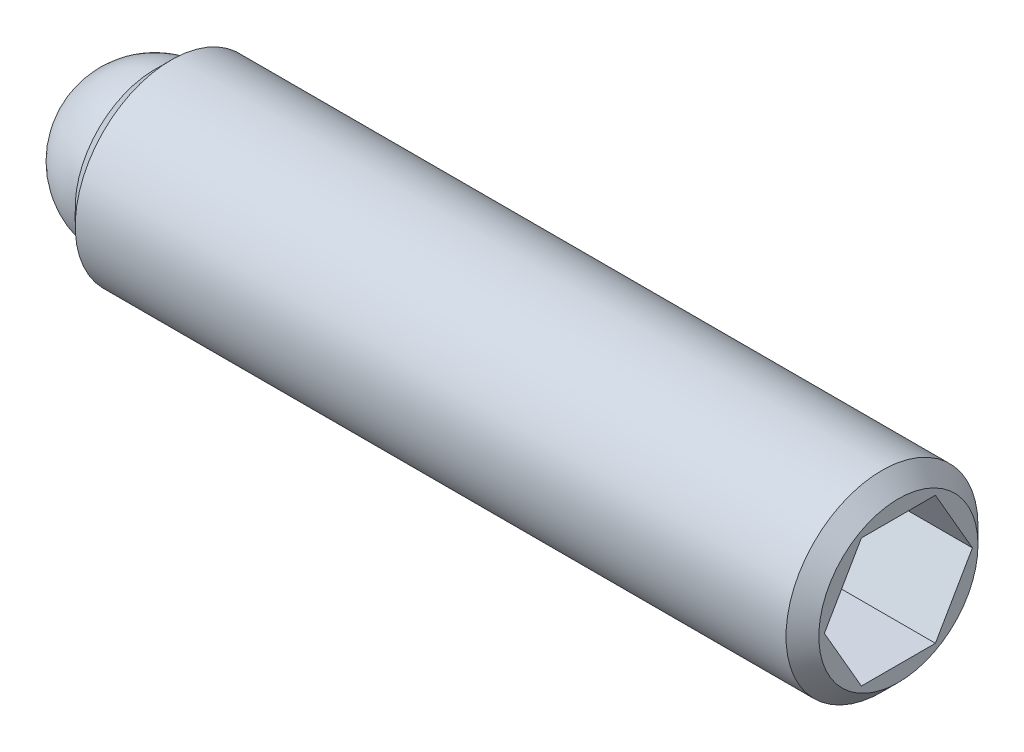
ISO-10303-21;
HEADER;
FILE_DESCRIPTION(('STEP AP214'),'2;1');
FILE_NAME('part.step','',(''),(''),'','','');
FILE_SCHEMA(('AUTOMOTIVE_DESIGN { 1 0 10303 214 1 1 1 1 }'));
ENDSEC;
DATA;
#1=APPLICATION_CONTEXT('core data for automotive mechanical design processes');
#2=APPLICATION_PROTOCOL_DEFINITION('international standard','automotive_design',2000,#1);
#3=PRODUCT_CONTEXT('',#1,'mechanical');
#4=PRODUCT('Part','Part','',(#3));
#5=PRODUCT_RELATED_PRODUCT_CATEGORY('part','',(#4));
#6=PRODUCT_DEFINITION_FORMATION('','',#4);
#7=PRODUCT_DEFINITION_CONTEXT('part definition',#1,'design');
#8=PRODUCT_DEFINITION('design','',#6,#7);
#9=PRODUCT_DEFINITION_SHAPE('','',#8);
#10=(LENGTH_UNIT() NAMED_UNIT(*) SI_UNIT(.MILLI.,.METRE.));
#11=(NAMED_UNIT(*) PLANE_ANGLE_UNIT() SI_UNIT($,.RADIAN.));
#12=(NAMED_UNIT(*) SI_UNIT($,.STERADIAN.) SOLID_ANGLE_UNIT());
#13=UNCERTAINTY_MEASURE_WITH_UNIT(LENGTH_MEASURE(1.E-05),#10,'distance_accuracy_value','');
#14=(GEOMETRIC_REPRESENTATION_CONTEXT(3) GLOBAL_UNCERTAINTY_ASSIGNED_CONTEXT((#13)) GLOBAL_UNIT_ASSIGNED_CONTEXT((#10,
#11,#12)) REPRESENTATION_CONTEXT('',''));
#15=CARTESIAN_POINT('',(0.,0.,0.));
#16=DIRECTION('',(0.,0.,1.));
#17=DIRECTION('',(1.,0.,0.));
#18=AXIS2_PLACEMENT_3D('',#15,#16,#17);
#19=CARTESIAN_POINT('',(0.,0.,0.));
#20=DIRECTION('',(0.,-1.,0.));
#21=DIRECTION('',(0.,0.,-1.));
#22=AXIS2_PLACEMENT_3D('',#19,#20,#21);
#23=SPHERICAL_SURFACE('',#22,1.190625);
#24=CARTESIAN_POINT('',(0.,-1.190625,0.));
#25=VERTEX_POINT('',#24);
#26=VERTEX_LOOP('',#25);
#27=FACE_BOUND('',#26,.T.);
#28=ADVANCED_FACE('F43',(#27),#23,.T.);
#29=CLOSED_SHELL('',(#28));
#30=MANIFOLD_SOLID_BREP('B2',#29);
#31=CARTESIAN_POINT('',(11.509375,0.,0.));
#32=DIRECTION('',(-1.,0.,0.));
#33=DIRECTION('',(0.,0.,1.));
#34=AXIS2_PLACEMENT_3D('',#31,#32,#33);
#35=CYLINDRICAL_SURFACE('',#34,1.4859);
#36=CARTESIAN_POINT('',(11.255375,0.,0.));
#37=DIRECTION('',(1.,0.,0.));
#38=DIRECTION('',(0.,0.,-1.));
#39=AXIS2_PLACEMENT_3D('',#36,#37,#38);
#40=CIRCLE('',#39,1.4859);
#41=CARTESIAN_POINT('',(11.255375,0.,-1.4859));
#42=VERTEX_POINT('',#41);
#43=EDGE_CURVE('E41',#42,#42,#40,.F.);
#44=ORIENTED_EDGE('',*,*,#43,.T.);
#45=EDGE_LOOP('',(#44));
#46=FACE_BOUND('',#45,.T.);
#47=CARTESIAN_POINT('',(0.254000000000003,0.,0.));
#48=DIRECTION('',(1.,0.,0.));
#49=DIRECTION('',(0.,0.,-1.));
#50=AXIS2_PLACEMENT_3D('',#47,#48,#49);
#51=CIRCLE('',#50,1.4859);
#52=CARTESIAN_POINT('',(0.254000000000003,0.,-1.4859));
#53=VERTEX_POINT('',#52);
#54=EDGE_CURVE('E159',#53,#53,#51,.T.);
#55=ORIENTED_EDGE('',*,*,#54,.T.);
#56=EDGE_LOOP('',(#55));
#57=FACE_BOUND('',#56,.T.);
#58=ADVANCED_FACE('F56',(#46,#57),#35,.T.);
#59=CARTESIAN_POINT('',(11.509375,0.,0.));
#60=DIRECTION('',(1.,0.,0.));
#61=DIRECTION('',(0.,0.,-1.));
#62=AXIS2_PLACEMENT_3D('',#59,#60,#61);
#63=PLANE('',#62);
#64=DIRECTION('',(0.,0.866025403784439,-0.5));
#65=VECTOR('',#64,1.);
#66=CARTESIAN_POINT('',(11.509375,-0.992187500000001,-0.572839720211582));
#67=LINE('',#66,#65);
#68=CARTESIAN_POINT('',(11.509375,-0.992187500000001,-0.572839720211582));
#69=VERTEX_POINT('',#68);
#70=CARTESIAN_POINT('',(11.509375,0.,-1.14567944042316));
#71=VERTEX_POINT('',#70);
#72=EDGE_CURVE('E71',#69,#71,#67,.T.);
#73=ORIENTED_EDGE('',*,*,#72,.F.);
#74=DIRECTION('',(0.,0.,-1.));
#75=VECTOR('',#74,1.);
#76=CARTESIAN_POINT('',(11.509375,-0.992187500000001,0.572839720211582));
#77=LINE('',#76,#75);
#78=CARTESIAN_POINT('',(11.509375,-0.992187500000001,0.572839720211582));
#79=VERTEX_POINT('',#78);
#80=EDGE_CURVE('E155',#79,#69,#77,.T.);
#81=ORIENTED_EDGE('',*,*,#80,.F.);
#82=DIRECTION('',(0.,-0.866025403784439,-0.5));
#83=VECTOR('',#82,1.);
#84=CARTESIAN_POINT('',(11.509375,0.,1.14567944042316));
#85=LINE('',#84,#83);
#86=CARTESIAN_POINT('',(11.509375,0.,1.14567944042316));
#87=VERTEX_POINT('',#86);
#88=EDGE_CURVE('E153',#87,#79,#85,.T.);
#89=ORIENTED_EDGE('',*,*,#88,.F.);
#90=DIRECTION('',(0.,-0.866025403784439,0.5));
#91=VECTOR('',#90,1.);
#92=CARTESIAN_POINT('',(11.509375,0.992187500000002,0.572839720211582));
#93=LINE('',#92,#91);
#94=CARTESIAN_POINT('',(11.509375,0.992187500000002,0.572839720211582));
#95=VERTEX_POINT('',#94);
#96=EDGE_CURVE('E119',#95,#87,#93,.T.);
#97=ORIENTED_EDGE('',*,*,#96,.F.);
#98=DIRECTION('',(0.,0.,1.));
#99=VECTOR('',#98,1.);
#100=CARTESIAN_POINT('',(11.509375,0.992187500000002,-0.572839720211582));
#101=LINE('',#100,#99);
#102=CARTESIAN_POINT('',(11.509375,0.992187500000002,-0.572839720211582));
#103=VERTEX_POINT('',#102);
#104=EDGE_CURVE('E149',#103,#95,#101,.T.);
#105=ORIENTED_EDGE('',*,*,#104,.F.);
#106=DIRECTION('',(0.,0.866025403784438,0.5));
#107=VECTOR('',#106,1.);
#108=CARTESIAN_POINT('',(11.509375,0.,-1.14567944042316));
#109=LINE('',#108,#107);
#110=EDGE_CURVE('E145',#71,#103,#109,.T.);
#111=ORIENTED_EDGE('',*,*,#110,.F.);
#112=EDGE_LOOP('',(#73,#81,#89,#97,#105,#111));
#113=FACE_BOUND('',#112,.T.);
#114=CARTESIAN_POINT('',(11.509375,0.,0.));
#115=DIRECTION('',(1.,0.,0.));
#116=DIRECTION('',(0.,0.,-1.));
#117=AXIS2_PLACEMENT_3D('',#114,#115,#116);
#118=CIRCLE('',#117,1.2319);
#119=CARTESIAN_POINT('',(11.509375,0.,-1.2319));
#120=VERTEX_POINT('',#119);
#121=EDGE_CURVE('E64',#120,#120,#118,.T.);
#122=ORIENTED_EDGE('',*,*,#121,.T.);
#123=EDGE_LOOP('',(#122));
#124=FACE_BOUND('',#123,.T.);
#125=ADVANCED_FACE('F172',(#113,#124),#63,.T.);
#126=CARTESIAN_POINT('',(0.,0.,0.));
#127=DIRECTION('',(1.,0.,0.));
#128=DIRECTION('',(0.,0.,-1.));
#129=AXIS2_PLACEMENT_3D('',#126,#127,#128);
#130=PLANE('',#129);
#131=CARTESIAN_POINT('',(0.,0.,0.));
#132=DIRECTION('',(-1.,0.,0.));
#133=DIRECTION('',(0.,0.,1.));
#134=AXIS2_PLACEMENT_3D('',#131,#132,#133);
#135=CIRCLE('',#134,1.190625);
#136=CARTESIAN_POINT('',(0.,0.,1.190625));
#137=VERTEX_POINT('',#136);
#138=EDGE_CURVE('E227',#137,#137,#135,.T.);
#139=ORIENTED_EDGE('',*,*,#138,.F.);
#140=EDGE_LOOP('',(#139));
#141=FACE_BOUND('',#140,.T.);
#142=CARTESIAN_POINT('',(0.,0.,0.));
#143=DIRECTION('',(1.,0.,0.));
#144=DIRECTION('',(0.,0.,-1.));
#145=AXIS2_PLACEMENT_3D('',#142,#143,#144);
#146=CIRCLE('',#145,1.2319);
#147=CARTESIAN_POINT('',(0.,0.,-1.2319));
#148=VERTEX_POINT('',#147);
#149=EDGE_CURVE('E167',#148,#148,#146,.F.);
#150=ORIENTED_EDGE('',*,*,#149,.T.);
#151=EDGE_LOOP('',(#150));
#152=FACE_BOUND('',#151,.T.);
#153=ADVANCED_FACE('F184',(#141,#152),#130,.F.);
#154=CARTESIAN_POINT('',(0.254000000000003,0.,0.));
#155=DIRECTION('',(1.,0.,0.));
#156=DIRECTION('',(0.,0.,-1.));
#157=AXIS2_PLACEMENT_3D('',#154,#155,#156);
#158=CONICAL_SURFACE('',#157,1.4859,0.78539816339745);
#159=ORIENTED_EDGE('',*,*,#149,.F.);
#160=EDGE_LOOP('',(#159));
#161=FACE_BOUND('',#160,.T.);
#162=ORIENTED_EDGE('',*,*,#54,.F.);
#163=EDGE_LOOP('',(#162));
#164=FACE_BOUND('',#163,.T.);
#165=ADVANCED_FACE('F176',(#161,#164),#158,.T.);
#166=CARTESIAN_POINT('',(11.509375,0.,0.));
#167=DIRECTION('',(-1.,0.,0.));
#168=DIRECTION('',(0.,0.,1.));
#169=AXIS2_PLACEMENT_3D('',#166,#167,#168);
#170=CONICAL_SURFACE('',#169,1.2319,0.785398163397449);
#171=ORIENTED_EDGE('',*,*,#43,.F.);
#172=EDGE_LOOP('',(#171));
#173=FACE_BOUND('',#172,.T.);
#174=ORIENTED_EDGE('',*,*,#121,.F.);
#175=EDGE_LOOP('',(#174));
#176=FACE_BOUND('',#175,.T.);
#177=ADVANCED_FACE('F58',(#173,#176),#170,.T.);
#178=CARTESIAN_POINT('',(9.223375,-0.992187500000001,-0.572839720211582));
#179=DIRECTION('',(0.,-0.5,-0.866025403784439));
#180=DIRECTION('',(0.,0.866025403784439,-0.5));
#181=AXIS2_PLACEMENT_3D('',#178,#179,#180);
#182=PLANE('',#181);
#183=ORIENTED_EDGE('',*,*,#72,.T.);
#184=DIRECTION('',(1.,0.,0.));
#185=VECTOR('',#184,1.);
#186=CARTESIAN_POINT('',(9.223375,0.,-1.14567944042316));
#187=LINE('',#186,#185);
#188=CARTESIAN_POINT('',(9.223375,0.,-1.14567944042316));
#189=VERTEX_POINT('',#188);
#190=EDGE_CURVE('E101',#189,#71,#187,.T.);
#191=ORIENTED_EDGE('',*,*,#190,.F.);
#192=DIRECTION('',(0.,0.866025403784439,-0.5));
#193=VECTOR('',#192,1.);
#194=CARTESIAN_POINT('',(9.223375,-0.992187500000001,-0.572839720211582));
#195=LINE('',#194,#193);
#196=CARTESIAN_POINT('',(9.223375,-0.992187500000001,-0.572839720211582));
#197=VERTEX_POINT('',#196);
#198=EDGE_CURVE('E157',#197,#189,#195,.T.);
#199=ORIENTED_EDGE('',*,*,#198,.F.);
#200=DIRECTION('',(1.,0.,0.));
#201=VECTOR('',#200,1.);
#202=CARTESIAN_POINT('',(9.223375,-0.992187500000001,-0.572839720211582));
#203=LINE('',#202,#201);
#204=EDGE_CURVE('E79',#197,#69,#203,.T.);
#205=ORIENTED_EDGE('',*,*,#204,.T.);
#206=EDGE_LOOP('',(#183,#191,#199,#205));
#207=FACE_BOUND('',#206,.T.);
#208=ADVANCED_FACE('F175',(#207),#182,.F.);
#209=CARTESIAN_POINT('',(9.223375,-0.992187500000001,0.572839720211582));
#210=DIRECTION('',(0.,-1.,0.));
#211=DIRECTION('',(0.,0.,-1.));
#212=AXIS2_PLACEMENT_3D('',#209,#210,#211);
#213=PLANE('',#212);
#214=ORIENTED_EDGE('',*,*,#80,.T.);
#215=ORIENTED_EDGE('',*,*,#204,.F.);
#216=DIRECTION('',(0.,0.,-1.));
#217=VECTOR('',#216,1.);
#218=CARTESIAN_POINT('',(9.223375,-0.992187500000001,0.572839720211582));
#219=LINE('',#218,#217);
#220=CARTESIAN_POINT('',(9.223375,-0.992187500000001,0.572839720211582));
#221=VERTEX_POINT('',#220);
#222=EDGE_CURVE('E131',#221,#197,#219,.T.);
#223=ORIENTED_EDGE('',*,*,#222,.F.);
#224=DIRECTION('',(1.,0.,0.));
#225=VECTOR('',#224,1.);
#226=CARTESIAN_POINT('',(9.223375,-0.992187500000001,0.572839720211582));
#227=LINE('',#226,#225);
#228=EDGE_CURVE('E123',#221,#79,#227,.T.);
#229=ORIENTED_EDGE('',*,*,#228,.T.);
#230=EDGE_LOOP('',(#214,#215,#223,#229));
#231=FACE_BOUND('',#230,.T.);
#232=ADVANCED_FACE('F182',(#231),#213,.F.);
#233=CARTESIAN_POINT('',(9.223375,0.,1.14567944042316));
#234=DIRECTION('',(0.,-0.5,0.866025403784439));
#235=DIRECTION('',(0.,-0.866025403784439,-0.5));
#236=AXIS2_PLACEMENT_3D('',#233,#234,#235);
#237=PLANE('',#236);
#238=ORIENTED_EDGE('',*,*,#88,.T.);
#239=ORIENTED_EDGE('',*,*,#228,.F.);
#240=DIRECTION('',(0.,-0.866025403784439,-0.5));
#241=VECTOR('',#240,1.);
#242=CARTESIAN_POINT('',(9.223375,0.,1.14567944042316));
#243=LINE('',#242,#241);
#244=CARTESIAN_POINT('',(9.223375,0.,1.14567944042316));
#245=VERTEX_POINT('',#244);
#246=EDGE_CURVE('E127',#245,#221,#243,.T.);
#247=ORIENTED_EDGE('',*,*,#246,.F.);
#248=DIRECTION('',(1.,0.,0.));
#249=VECTOR('',#248,1.);
#250=CARTESIAN_POINT('',(9.223375,0.,1.14567944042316));
#251=LINE('',#250,#249);
#252=EDGE_CURVE('E112',#245,#87,#251,.T.);
#253=ORIENTED_EDGE('',*,*,#252,.T.);
#254=EDGE_LOOP('',(#238,#239,#247,#253));
#255=FACE_BOUND('',#254,.T.);
#256=ADVANCED_FACE('F128',(#255),#237,.F.);
#257=CARTESIAN_POINT('',(9.223375,0.992187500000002,0.572839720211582));
#258=DIRECTION('',(0.,0.5,0.866025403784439));
#259=DIRECTION('',(0.,-0.866025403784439,0.5));
#260=AXIS2_PLACEMENT_3D('',#257,#258,#259);
#261=PLANE('',#260);
#262=ORIENTED_EDGE('',*,*,#96,.T.);
#263=ORIENTED_EDGE('',*,*,#252,.F.);
#264=DIRECTION('',(0.,-0.866025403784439,0.5));
#265=VECTOR('',#264,1.);
#266=CARTESIAN_POINT('',(9.223375,0.992187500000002,0.572839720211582));
#267=LINE('',#266,#265);
#268=CARTESIAN_POINT('',(9.223375,0.992187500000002,0.572839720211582));
#269=VERTEX_POINT('',#268);
#270=EDGE_CURVE('E116',#269,#245,#267,.T.);
#271=ORIENTED_EDGE('',*,*,#270,.F.);
#272=DIRECTION('',(1.,0.,0.));
#273=VECTOR('',#272,1.);
#274=CARTESIAN_POINT('',(9.223375,0.992187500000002,0.572839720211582));
#275=LINE('',#274,#273);
#276=EDGE_CURVE('E124',#269,#95,#275,.T.);
#277=ORIENTED_EDGE('',*,*,#276,.T.);
#278=EDGE_LOOP('',(#262,#263,#271,#277));
#279=FACE_BOUND('',#278,.T.);
#280=ADVANCED_FACE('F114',(#279),#261,.F.);
#281=CARTESIAN_POINT('',(9.223375,0.992187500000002,-0.572839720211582));
#282=DIRECTION('',(0.,1.,0.));
#283=DIRECTION('',(0.,0.,1.));
#284=AXIS2_PLACEMENT_3D('',#281,#282,#283);
#285=PLANE('',#284);
#286=ORIENTED_EDGE('',*,*,#104,.T.);
#287=ORIENTED_EDGE('',*,*,#276,.F.);
#288=DIRECTION('',(0.,0.,1.));
#289=VECTOR('',#288,1.);
#290=CARTESIAN_POINT('',(9.223375,0.992187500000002,-0.572839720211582));
#291=LINE('',#290,#289);
#292=CARTESIAN_POINT('',(9.223375,0.992187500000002,-0.572839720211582));
#293=VERTEX_POINT('',#292);
#294=EDGE_CURVE('E137',#293,#269,#291,.T.);
#295=ORIENTED_EDGE('',*,*,#294,.F.);
#296=DIRECTION('',(1.,0.,0.));
#297=VECTOR('',#296,1.);
#298=CARTESIAN_POINT('',(9.223375,0.992187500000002,-0.572839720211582));
#299=LINE('',#298,#297);
#300=EDGE_CURVE('E162',#293,#103,#299,.T.);
#301=ORIENTED_EDGE('',*,*,#300,.T.);
#302=EDGE_LOOP('',(#286,#287,#295,#301));
#303=FACE_BOUND('',#302,.T.);
#304=ADVANCED_FACE('F203',(#303),#285,.F.);
#305=CARTESIAN_POINT('',(9.223375,0.,-1.14567944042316));
#306=DIRECTION('',(0.,0.5,-0.866025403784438));
#307=DIRECTION('',(0.,0.866025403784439,0.5));
#308=AXIS2_PLACEMENT_3D('',#305,#306,#307);
#309=PLANE('',#308);
#310=ORIENTED_EDGE('',*,*,#110,.T.);
#311=ORIENTED_EDGE('',*,*,#300,.F.);
#312=DIRECTION('',(0.,0.866025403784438,0.5));
#313=VECTOR('',#312,1.);
#314=CARTESIAN_POINT('',(9.223375,0.,-1.14567944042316));
#315=LINE('',#314,#313);
#316=EDGE_CURVE('E139',#189,#293,#315,.T.);
#317=ORIENTED_EDGE('',*,*,#316,.F.);
#318=ORIENTED_EDGE('',*,*,#190,.T.);
#319=EDGE_LOOP('',(#310,#311,#317,#318));
#320=FACE_BOUND('',#319,.T.);
#321=ADVANCED_FACE('F200',(#320),#309,.F.);
#322=CARTESIAN_POINT('',(9.223375,0.,0.));
#323=DIRECTION('',(1.,0.,0.));
#324=DIRECTION('',(0.,0.,-1.));
#325=AXIS2_PLACEMENT_3D('',#322,#323,#324);
#326=PLANE('',#325);
#327=ORIENTED_EDGE('',*,*,#198,.T.);
#328=ORIENTED_EDGE('',*,*,#316,.T.);
#329=ORIENTED_EDGE('',*,*,#294,.T.);
#330=ORIENTED_EDGE('',*,*,#270,.T.);
#331=ORIENTED_EDGE('',*,*,#246,.T.);
#332=ORIENTED_EDGE('',*,*,#222,.T.);
#333=EDGE_LOOP('',(#327,#328,#329,#330,#331,#332));
#334=FACE_BOUND('',#333,.T.);
#335=ADVANCED_FACE('F134',(#334),#326,.T.);
#336=CARTESIAN_POINT('',(1.190625,0.,0.));
#337=DIRECTION('',(-1.,0.,0.));
#338=DIRECTION('',(0.,0.,1.));
#339=AXIS2_PLACEMENT_3D('',#336,#337,#338);
#340=CYLINDRICAL_SURFACE('',#339,1.190625);
#341=CARTESIAN_POINT('',(1.190625,0.,0.));
#342=DIRECTION('',(-1.,0.,0.));
#343=DIRECTION('',(0.,0.,1.));
#344=AXIS2_PLACEMENT_3D('',#341,#342,#343);
#345=CIRCLE('',#344,1.190625);
#346=CARTESIAN_POINT('',(1.190625,0.,1.190625));
#347=VERTEX_POINT('',#346);
#348=EDGE_CURVE('E146',#347,#347,#345,.T.);
#349=CARTESIAN_POINT('',(1.190625,0.,1.190625));
#350=CARTESIAN_POINT('',(1.17822265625,0.,1.190625));
#351=CARTESIAN_POINT('',(1.1658203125,0.,1.190625));
#352=CARTESIAN_POINT('',(1.141015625,0.,1.190625));
#353=CARTESIAN_POINT('',(1.12861328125,0.,1.190625));
#354=CARTESIAN_POINT('',(1.10380859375,0.,1.190625));
#355=CARTESIAN_POINT('',(1.09140625,0.,1.190625));
#356=CARTESIAN_POINT('',(1.0666015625,0.,1.190625));
#357=CARTESIAN_POINT('',(1.05419921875,0.,1.190625));
#358=CARTESIAN_POINT('',(1.02939453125,0.,1.190625));
#359=CARTESIAN_POINT('',(1.0169921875,0.,1.190625));
#360=CARTESIAN_POINT('',(0.9921875,0.,1.190625));
#361=CARTESIAN_POINT('',(0.97978515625,0.,1.190625));
#362=CARTESIAN_POINT('',(0.95498046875,0.,1.190625));
#363=CARTESIAN_POINT('',(0.942578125,0.,1.190625));
#364=CARTESIAN_POINT('',(0.9177734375,0.,1.190625));
#365=CARTESIAN_POINT('',(0.90537109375,0.,1.190625));
#366=CARTESIAN_POINT('',(0.88056640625,0.,1.190625));
#367=CARTESIAN_POINT('',(0.8681640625,0.,1.190625));
#368=CARTESIAN_POINT('',(0.843359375,0.,1.190625));
#369=CARTESIAN_POINT('',(0.83095703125,0.,1.190625));
#370=CARTESIAN_POINT('',(0.80615234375,0.,1.190625));
#371=CARTESIAN_POINT('',(0.79375,0.,1.190625));
#372=CARTESIAN_POINT('',(0.7689453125,0.,1.190625));
#373=CARTESIAN_POINT('',(0.75654296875,0.,1.190625));
#374=CARTESIAN_POINT('',(0.73173828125,0.,1.190625));
#375=CARTESIAN_POINT('',(0.7193359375,0.,1.190625));
#376=CARTESIAN_POINT('',(0.69453125,0.,1.190625));
#377=CARTESIAN_POINT('',(0.68212890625,0.,1.190625));
#378=CARTESIAN_POINT('',(0.65732421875,0.,1.190625));
#379=CARTESIAN_POINT('',(0.644921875,0.,1.190625));
#380=CARTESIAN_POINT('',(0.6201171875,0.,1.190625));
#381=CARTESIAN_POINT('',(0.60771484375,0.,1.190625));
#382=CARTESIAN_POINT('',(0.58291015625,0.,1.190625));
#383=CARTESIAN_POINT('',(0.5705078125,0.,1.190625));
#384=CARTESIAN_POINT('',(0.545703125,0.,1.190625));
#385=CARTESIAN_POINT('',(0.53330078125,0.,1.190625));
#386=CARTESIAN_POINT('',(0.50849609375,0.,1.190625));
#387=CARTESIAN_POINT('',(0.49609375,0.,1.190625));
#388=CARTESIAN_POINT('',(0.4712890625,0.,1.190625));
#389=CARTESIAN_POINT('',(0.45888671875,0.,1.190625));
#390=CARTESIAN_POINT('',(0.43408203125,0.,1.190625));
#391=CARTESIAN_POINT('',(0.4216796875,0.,1.190625));
#392=CARTESIAN_POINT('',(0.396875,0.,1.190625));
#393=CARTESIAN_POINT('',(0.38447265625,0.,1.190625));
#394=CARTESIAN_POINT('',(0.35966796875,0.,1.190625));
#395=CARTESIAN_POINT('',(0.347265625,0.,1.190625));
#396=CARTESIAN_POINT('',(0.3224609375,0.,1.190625));
#397=CARTESIAN_POINT('',(0.31005859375,0.,1.190625));
#398=CARTESIAN_POINT('',(0.28525390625,0.,1.190625));
#399=CARTESIAN_POINT('',(0.2728515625,0.,1.190625));
#400=CARTESIAN_POINT('',(0.248046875,0.,1.190625));
#401=CARTESIAN_POINT('',(0.23564453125,0.,1.190625));
#402=CARTESIAN_POINT('',(0.21083984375,0.,1.190625));
#403=CARTESIAN_POINT('',(0.1984375,0.,1.190625));
#404=CARTESIAN_POINT('',(0.1736328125,0.,1.190625));
#405=CARTESIAN_POINT('',(0.16123046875,0.,1.190625));
#406=CARTESIAN_POINT('',(0.13642578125,0.,1.190625));
#407=CARTESIAN_POINT('',(0.1240234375,0.,1.190625));
#408=CARTESIAN_POINT('',(0.0992187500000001,0.,1.190625));
#409=CARTESIAN_POINT('',(0.08681640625,0.,1.190625));
#410=CARTESIAN_POINT('',(0.06201171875,0.,1.190625));
#411=CARTESIAN_POINT('',(0.049609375,0.,1.190625));
#412=CARTESIAN_POINT('',(0.0248046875,0.,1.190625));
#413=CARTESIAN_POINT('',(0.01240234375,0.,1.190625));
#414=CARTESIAN_POINT('',(0.,0.,1.190625));
#415=B_SPLINE_CURVE_WITH_KNOTS('',3,(#349,#350,#351,#352,#353,#354,#355,#356,#357,#358,#359,
#360,#361,#362,#363,#364,#365,#366,#367,#368,#369,#370,#371,#372,#373,#374,#375,#376,#377,#378,
#379,#380,#381,#382,#383,#384,#385,#386,#387,#388,#389,#390,#391,#392,#393,#394,#395,#396,#397,
#398,#399,#400,#401,#402,#403,#404,#405,#406,#407,#408,#409,#410,#411,#412,#413,#414),
.UNSPECIFIED.,.F.,.F.,(4,2,2,2,2,2,2,2,2,2,2,2,2,2,2,2,2,2,2,2,2,2,2,2,2,2,2,2,2,2,2,2,4),(0.,
0.03720703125,0.0744140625,0.11162109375,0.148828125,0.18603515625,0.2232421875,0.26044921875,
0.29765625,0.33486328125,0.3720703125,0.40927734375,0.446484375,0.48369140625,0.5208984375,
0.55810546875,0.5953125,0.63251953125,0.6697265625,0.70693359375,0.744140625,0.78134765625,
0.8185546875,0.85576171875,0.89296875,0.93017578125,0.9673828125,1.00458984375,1.041796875,
1.07900390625,1.1162109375,1.15341796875,1.190625),.UNSPECIFIED.);
#416=EDGE_CURVE('BSEAM216',#347,#137,#415,.T.);
#417=ORIENTED_EDGE('',*,*,#348,.F.);
#418=ORIENTED_EDGE('',*,*,#138,.T.);
#419=ORIENTED_EDGE('',*,*,#416,.T.);
#420=ORIENTED_EDGE('',*,*,#416,.F.);
#421=EDGE_LOOP('',(#417,#419,#418,#420));
#422=FACE_BOUND('',#421,.T.);
#423=ADVANCED_FACE('F216',(#422),#340,.F.);
#424=CARTESIAN_POINT('',(1.190625,0.,0.));
#425=DIRECTION('',(-1.,0.,0.));
#426=DIRECTION('',(0.,0.,1.));
#427=AXIS2_PLACEMENT_3D('',#424,#425,#426);
#428=PLANE('',#427);
#429=ORIENTED_EDGE('',*,*,#348,.T.);
#430=EDGE_LOOP('',(#429));
#431=FACE_BOUND('',#430,.T.);
#432=ADVANCED_FACE('F219',(#431),#428,.T.);
#433=CLOSED_SHELL('',(#58,#125,#153,#165,#177,#208,#232,#256,#280,#304,#321,#335,#423,#432));
#434=MANIFOLD_SOLID_BREP('B6',#433);
#435=ADVANCED_BREP_SHAPE_REPRESENTATION('',(#18,#30,#434),#14);
#436=SHAPE_DEFINITION_REPRESENTATION(#9,#435);
ENDSEC;
END-ISO-10303-21;
